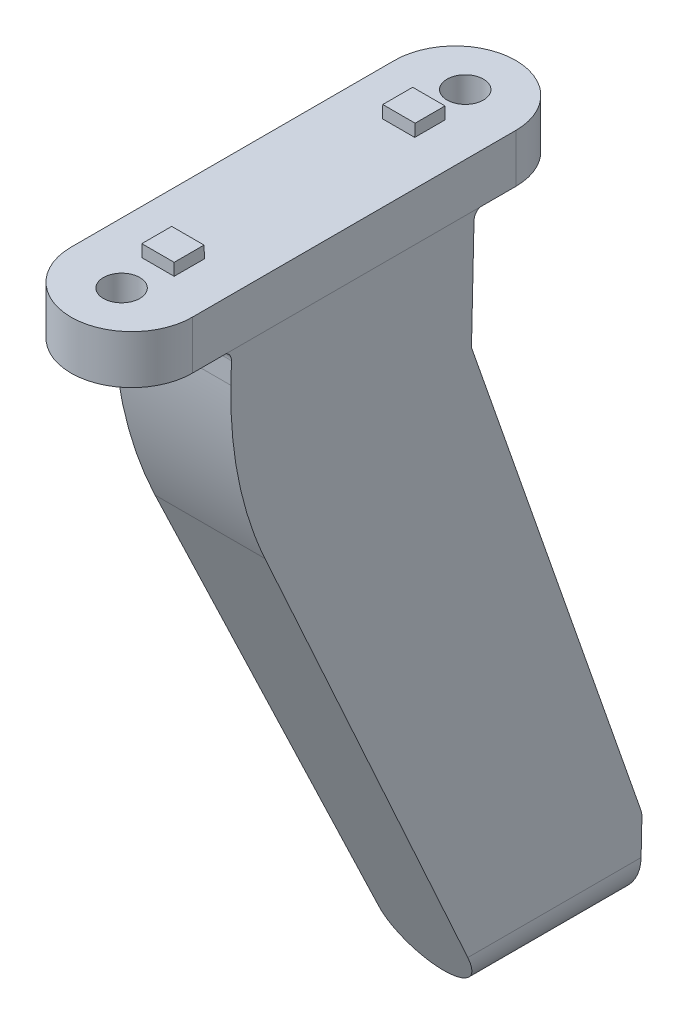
ISO-10303-21;
HEADER;
FILE_DESCRIPTION(('STEP AP214'),'2;1');
FILE_NAME('part.step','',(''),(''),'','','');
FILE_SCHEMA(('AUTOMOTIVE_DESIGN { 1 0 10303 214 1 1 1 1 }'));
ENDSEC;
DATA;
#1=APPLICATION_CONTEXT('core data for automotive mechanical design processes');
#2=APPLICATION_PROTOCOL_DEFINITION('international standard','automotive_design',2000,#1);
#3=PRODUCT_CONTEXT('',#1,'mechanical');
#4=PRODUCT('Part','Part','',(#3));
#5=PRODUCT_RELATED_PRODUCT_CATEGORY('part','',(#4));
#6=PRODUCT_DEFINITION_FORMATION('','',#4);
#7=PRODUCT_DEFINITION_CONTEXT('part definition',#1,'design');
#8=PRODUCT_DEFINITION('design','',#6,#7);
#9=PRODUCT_DEFINITION_SHAPE('','',#8);
#10=(LENGTH_UNIT() NAMED_UNIT(*) SI_UNIT(.MILLI.,.METRE.));
#11=(NAMED_UNIT(*) PLANE_ANGLE_UNIT() SI_UNIT($,.RADIAN.));
#12=(NAMED_UNIT(*) SI_UNIT($,.STERADIAN.) SOLID_ANGLE_UNIT());
#13=UNCERTAINTY_MEASURE_WITH_UNIT(LENGTH_MEASURE(1.E-05),#10,'distance_accuracy_value','');
#14=(GEOMETRIC_REPRESENTATION_CONTEXT(3) GLOBAL_UNCERTAINTY_ASSIGNED_CONTEXT((#13)) GLOBAL_UNIT_ASSIGNED_CONTEXT((#10,
#11,#12)) REPRESENTATION_CONTEXT('',''));
#15=CARTESIAN_POINT('',(0.,0.,0.));
#16=DIRECTION('',(0.,0.,1.));
#17=DIRECTION('',(1.,0.,0.));
#18=AXIS2_PLACEMENT_3D('',#15,#16,#17);
#19=CARTESIAN_POINT('',(0.,-9.7,0.));
#20=DIRECTION('',(0.,-1.,0.));
#21=DIRECTION('',(0.,0.,-1.));
#22=AXIS2_PLACEMENT_3D('',#19,#20,#21);
#23=CONICAL_SURFACE('',#22,6.825,0.790803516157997);
#24=CARTESIAN_POINT('',(0.,-7.4,0.));
#25=DIRECTION('',(0.,-1.,0.));
#26=DIRECTION('',(0.,0.,-1.));
#27=AXIS2_PLACEMENT_3D('',#24,#25,#26);
#28=CIRCLE('',#27,4.5);
#29=CARTESIAN_POINT('',(0.,-7.4,-4.5));
#30=VERTEX_POINT('',#29);
#31=EDGE_CURVE('E11',#30,#30,#28,.T.);
#32=ORIENTED_EDGE('',*,*,#31,.F.);
#33=EDGE_LOOP('',(#32));
#34=FACE_BOUND('',#33,.T.);
#35=CARTESIAN_POINT('',(0.,-12.,0.));
#36=DIRECTION('',(0.,1.,0.));
#37=DIRECTION('',(1.,0.,0.));
#38=AXIS2_PLACEMENT_3D('',#35,#36,#37);
#39=CIRCLE('',#38,9.15);
#40=CARTESIAN_POINT('',(9.15,-12.,0.));
#41=VERTEX_POINT('',#40);
#42=EDGE_CURVE('E292',#41,#41,#39,.T.);
#43=ORIENTED_EDGE('',*,*,#42,.F.);
#44=EDGE_LOOP('',(#43));
#45=FACE_BOUND('',#44,.T.);
#46=ADVANCED_FACE('F35',(#34,#45),#23,.F.);
#47=CARTESIAN_POINT('',(0.,-3.7,0.));
#48=DIRECTION('',(0.,1.,0.));
#49=DIRECTION('',(1.,0.,0.));
#50=AXIS2_PLACEMENT_3D('',#47,#48,#49);
#51=CYLINDRICAL_SURFACE('',#50,4.5);
#52=CARTESIAN_POINT('',(0.,0.,0.));
#53=DIRECTION('',(0.,-1.,0.));
#54=DIRECTION('',(0.,0.,-1.));
#55=AXIS2_PLACEMENT_3D('',#52,#53,#54);
#56=CIRCLE('',#55,4.5);
#57=CARTESIAN_POINT('',(0.,0.,-4.5));
#58=VERTEX_POINT('',#57);
#59=EDGE_CURVE('E200',#58,#58,#56,.T.);
#60=ORIENTED_EDGE('',*,*,#59,.F.);
#61=EDGE_LOOP('',(#60));
#62=FACE_BOUND('',#61,.T.);
#63=ORIENTED_EDGE('',*,*,#31,.T.);
#64=EDGE_LOOP('',(#63));
#65=FACE_BOUND('',#64,.T.);
#66=ADVANCED_FACE('F461',(#62,#65),#51,.F.);
#67=CARTESIAN_POINT('',(0.,-9.7,85.));
#68=DIRECTION('',(0.,-1.,0.));
#69=DIRECTION('',(0.,0.,-1.));
#70=AXIS2_PLACEMENT_3D('',#67,#68,#69);
#71=CONICAL_SURFACE('',#70,6.825,0.790803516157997);
#72=CARTESIAN_POINT('',(0.,-7.4,85.));
#73=DIRECTION('',(0.,-1.,0.));
#74=DIRECTION('',(0.,0.,-1.));
#75=AXIS2_PLACEMENT_3D('',#72,#73,#74);
#76=CIRCLE('',#75,4.5);
#77=CARTESIAN_POINT('',(0.,-7.4,80.5));
#78=VERTEX_POINT('',#77);
#79=EDGE_CURVE('E44',#78,#78,#76,.T.);
#80=ORIENTED_EDGE('',*,*,#79,.F.);
#81=EDGE_LOOP('',(#80));
#82=FACE_BOUND('',#81,.T.);
#83=CARTESIAN_POINT('',(0.,-12.,85.));
#84=DIRECTION('',(0.,1.,0.));
#85=DIRECTION('',(1.,0.,0.));
#86=AXIS2_PLACEMENT_3D('',#83,#84,#85);
#87=CIRCLE('',#86,9.15);
#88=CARTESIAN_POINT('',(9.15,-12.,85.));
#89=VERTEX_POINT('',#88);
#90=EDGE_CURVE('E233',#89,#89,#87,.T.);
#91=ORIENTED_EDGE('',*,*,#90,.F.);
#92=EDGE_LOOP('',(#91));
#93=FACE_BOUND('',#92,.T.);
#94=ADVANCED_FACE('F467',(#82,#93),#71,.F.);
#95=CARTESIAN_POINT('',(0.,-3.7,85.));
#96=DIRECTION('',(0.,1.,0.));
#97=DIRECTION('',(1.,0.,0.));
#98=AXIS2_PLACEMENT_3D('',#95,#96,#97);
#99=CYLINDRICAL_SURFACE('',#98,4.5);
#100=CARTESIAN_POINT('',(0.,0.,85.));
#101=DIRECTION('',(0.,-1.,0.));
#102=DIRECTION('',(0.,0.,-1.));
#103=AXIS2_PLACEMENT_3D('',#100,#101,#102);
#104=CIRCLE('',#103,4.5);
#105=CARTESIAN_POINT('',(0.,0.,80.5));
#106=VERTEX_POINT('',#105);
#107=EDGE_CURVE('E306',#106,#106,#104,.T.);
#108=ORIENTED_EDGE('',*,*,#107,.F.);
#109=EDGE_LOOP('',(#108));
#110=FACE_BOUND('',#109,.T.);
#111=ORIENTED_EDGE('',*,*,#79,.T.);
#112=EDGE_LOOP('',(#111));
#113=FACE_BOUND('',#112,.T.);
#114=ADVANCED_FACE('F478',(#110,#113),#99,.F.);
#115=CARTESIAN_POINT('',(0.,-175.,-17.5));
#116=DIRECTION('',(0.,0.,1.));
#117=DIRECTION('',(1.,0.,0.));
#118=AXIS2_PLACEMENT_3D('',#115,#116,#117);
#119=CYLINDRICAL_SURFACE('',#118,4.188);
#120=CARTESIAN_POINT('',(0.,-175.,-2.5));
#121=DIRECTION('',(0.,0.,-1.));
#122=DIRECTION('',(0.,-1.,0.));
#123=AXIS2_PLACEMENT_3D('',#120,#121,#122);
#124=CIRCLE('',#123,4.188);
#125=CARTESIAN_POINT('',(0.,-179.188,-2.5));
#126=VERTEX_POINT('',#125);
#127=EDGE_CURVE('E303',#126,#126,#124,.T.);
#128=ORIENTED_EDGE('',*,*,#127,.F.);
#129=EDGE_LOOP('',(#128));
#130=FACE_BOUND('',#129,.T.);
#131=CARTESIAN_POINT('',(0.,-175.,-32.50000001));
#132=DIRECTION('',(0.,0.,1.));
#133=DIRECTION('',(1.,0.,0.));
#134=AXIS2_PLACEMENT_3D('',#131,#132,#133);
#135=CIRCLE('',#134,4.188);
#136=CARTESIAN_POINT('',(4.188,-175.,-32.50000001));
#137=VERTEX_POINT('',#136);
#138=EDGE_CURVE('E222',#137,#137,#135,.T.);
#139=ORIENTED_EDGE('',*,*,#138,.F.);
#140=EDGE_LOOP('',(#139));
#141=FACE_BOUND('',#140,.T.);
#142=ADVANCED_FACE('F480',(#130,#141),#119,.F.);
#143=CARTESIAN_POINT('',(0.,-175.,-1.29102853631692));
#144=DIRECTION('',(0.,0.,-1.));
#145=DIRECTION('',(0.,-1.,0.));
#146=AXIS2_PLACEMENT_3D('',#143,#144,#145);
#147=CONICAL_SURFACE('',#146,2.094,1.0471975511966);
#148=CARTESIAN_POINT('',(0.,-175.,-0.0820570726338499));
#149=VERTEX_POINT('',#148);
#150=VERTEX_LOOP('',#149);
#151=FACE_BOUND('',#150,.T.);
#152=ORIENTED_EDGE('',*,*,#127,.T.);
#153=EDGE_LOOP('',(#152));
#154=FACE_BOUND('',#153,.T.);
#155=ADVANCED_FACE('F474',(#151,#154),#147,.F.);
#156=CARTESIAN_POINT('',(-4.00000000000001,1.34844881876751,72.0477554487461));
#157=DIRECTION('',(-1.,0.,0.));
#158=DIRECTION('',(0.,0.,1.));
#159=AXIS2_PLACEMENT_3D('',#156,#157,#158);
#160=PLANE('',#159);
#161=DIRECTION('',(0.,0.,-1.));
#162=VECTOR('',#161,1.);
#163=CARTESIAN_POINT('',(-4.00000000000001,0.,76.));
#164=LINE('',#163,#162);
#165=CARTESIAN_POINT('',(-4.00000000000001,0.,76.));
#166=VERTEX_POINT('',#165);
#167=CARTESIAN_POINT('',(-4.00000000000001,0.,68.5000020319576));
#168=VERTEX_POINT('',#167);
#169=EDGE_CURVE('E56',#166,#168,#164,.T.);
#170=ORIENTED_EDGE('',*,*,#169,.F.);
#171=DIRECTION('',(0.,-1.,0.));
#172=VECTOR('',#171,1.);
#173=CARTESIAN_POINT('',(-4.00000000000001,3.,76.));
#174=LINE('',#173,#172);
#175=CARTESIAN_POINT('',(-4.00000000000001,3.,76.));
#176=VERTEX_POINT('',#175);
#177=EDGE_CURVE('E317',#176,#166,#174,.T.);
#178=ORIENTED_EDGE('',*,*,#177,.F.);
#179=DIRECTION('',(0.,0.,1.));
#180=VECTOR('',#179,1.);
#181=CARTESIAN_POINT('',(-4.00000000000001,3.,68.60476434));
#182=LINE('',#181,#180);
#183=CARTESIAN_POINT('',(-4.00000000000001,3.,68.60476434));
#184=VERTEX_POINT('',#183);
#185=EDGE_CURVE('E321',#184,#176,#182,.T.);
#186=ORIENTED_EDGE('',*,*,#185,.F.);
#187=DIRECTION('',(0.,0.999390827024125,0.0348994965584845));
#188=VECTOR('',#187,1.);
#189=CARTESIAN_POINT('',(-4.00000000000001,0.,68.5000020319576));
#190=LINE('',#189,#188);
#191=EDGE_CURVE('E312',#168,#184,#190,.T.);
#192=ORIENTED_EDGE('',*,*,#191,.F.);
#193=EDGE_LOOP('',(#170,#178,#186,#192));
#194=FACE_BOUND('',#193,.T.);
#195=ADVANCED_FACE('F625',(#194),#160,.T.);
#196=CARTESIAN_POINT('',(3.99999999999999,-0.9651005,68.46629998));
#197=DIRECTION('',(0.,0.0348994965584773,-0.999390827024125));
#198=DIRECTION('',(0.,0.999390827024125,0.0348994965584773));
#199=AXIS2_PLACEMENT_3D('',#196,#197,#198);
#200=PLANE('',#199);
#201=DIRECTION('',(1.,0.,0.));
#202=VECTOR('',#201,1.);
#203=CARTESIAN_POINT('',(-4.00000000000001,0.,68.5000020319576));
#204=LINE('',#203,#202);
#205=CARTESIAN_POINT('',(3.99999999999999,0.,68.5000020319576));
#206=VERTEX_POINT('',#205);
#207=EDGE_CURVE('E316',#168,#206,#204,.T.);
#208=ORIENTED_EDGE('',*,*,#207,.F.);
#209=ORIENTED_EDGE('',*,*,#191,.T.);
#210=DIRECTION('',(-1.,0.,0.));
#211=VECTOR('',#210,1.);
#212=CARTESIAN_POINT('',(3.99999999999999,3.,68.60476434));
#213=LINE('',#212,#211);
#214=CARTESIAN_POINT('',(3.99999999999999,3.,68.60476434));
#215=VERTEX_POINT('',#214);
#216=EDGE_CURVE('E319',#215,#184,#213,.T.);
#217=ORIENTED_EDGE('',*,*,#216,.F.);
#218=DIRECTION('',(0.,0.999390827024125,0.0348994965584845));
#219=VECTOR('',#218,1.);
#220=CARTESIAN_POINT('',(3.99999999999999,0.,68.5000020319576));
#221=LINE('',#220,#219);
#222=EDGE_CURVE('E330',#206,#215,#221,.T.);
#223=ORIENTED_EDGE('',*,*,#222,.F.);
#224=EDGE_LOOP('',(#208,#209,#217,#223));
#225=FACE_BOUND('',#224,.T.);
#226=ADVANCED_FACE('F632',(#225),#200,.T.);
#227=CARTESIAN_POINT('',(3.99999999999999,3.,68.60476434));
#228=DIRECTION('',(0.,1.,0.));
#229=DIRECTION('',(0.,0.,1.));
#230=AXIS2_PLACEMENT_3D('',#227,#228,#229);
#231=PLANE('',#230);
#232=ORIENTED_EDGE('',*,*,#185,.T.);
#233=DIRECTION('',(-1.,0.,0.));
#234=VECTOR('',#233,1.);
#235=CARTESIAN_POINT('',(3.99999999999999,3.,76.));
#236=LINE('',#235,#234);
#237=CARTESIAN_POINT('',(3.99999999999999,3.,76.));
#238=VERTEX_POINT('',#237);
#239=EDGE_CURVE('E320',#238,#176,#236,.T.);
#240=ORIENTED_EDGE('',*,*,#239,.F.);
#241=DIRECTION('',(0.,0.,1.));
#242=VECTOR('',#241,1.);
#243=CARTESIAN_POINT('',(3.99999999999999,3.,68.60476434));
#244=LINE('',#243,#242);
#245=EDGE_CURVE('E332',#215,#238,#244,.T.);
#246=ORIENTED_EDGE('',*,*,#245,.F.);
#247=ORIENTED_EDGE('',*,*,#216,.T.);
#248=EDGE_LOOP('',(#232,#240,#246,#247));
#249=FACE_BOUND('',#248,.T.);
#250=ADVANCED_FACE('F640',(#249),#231,.T.);
#251=CARTESIAN_POINT('',(3.99999999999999,3.,76.));
#252=DIRECTION('',(0.,0.,1.));
#253=DIRECTION('',(1.,0.,0.));
#254=AXIS2_PLACEMENT_3D('',#251,#252,#253);
#255=PLANE('',#254);
#256=ORIENTED_EDGE('',*,*,#177,.T.);
#257=DIRECTION('',(-1.,0.,0.));
#258=VECTOR('',#257,1.);
#259=CARTESIAN_POINT('',(3.99999999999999,0.,76.));
#260=LINE('',#259,#258);
#261=CARTESIAN_POINT('',(3.99999999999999,0.,76.));
#262=VERTEX_POINT('',#261);
#263=EDGE_CURVE('E300',#262,#166,#260,.T.);
#264=ORIENTED_EDGE('',*,*,#263,.F.);
#265=DIRECTION('',(0.,-1.,0.));
#266=VECTOR('',#265,1.);
#267=CARTESIAN_POINT('',(3.99999999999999,3.,76.));
#268=LINE('',#267,#266);
#269=EDGE_CURVE('E336',#238,#262,#268,.T.);
#270=ORIENTED_EDGE('',*,*,#269,.F.);
#271=ORIENTED_EDGE('',*,*,#239,.T.);
#272=EDGE_LOOP('',(#256,#264,#270,#271));
#273=FACE_BOUND('',#272,.T.);
#274=ADVANCED_FACE('F649',(#273),#255,.T.);
#275=CARTESIAN_POINT('',(3.99999999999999,1.34844881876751,72.0477554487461));
#276=DIRECTION('',(-1.,0.,0.));
#277=DIRECTION('',(0.,0.,1.));
#278=AXIS2_PLACEMENT_3D('',#275,#276,#277);
#279=PLANE('',#278);
#280=DIRECTION('',(0.,0.,1.));
#281=VECTOR('',#280,1.);
#282=CARTESIAN_POINT('',(3.99999999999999,0.,68.5000020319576));
#283=LINE('',#282,#281);
#284=EDGE_CURVE('E327',#206,#262,#283,.T.);
#285=ORIENTED_EDGE('',*,*,#284,.F.);
#286=ORIENTED_EDGE('',*,*,#222,.T.);
#287=ORIENTED_EDGE('',*,*,#245,.T.);
#288=ORIENTED_EDGE('',*,*,#269,.T.);
#289=EDGE_LOOP('',(#285,#286,#287,#288));
#290=FACE_BOUND('',#289,.T.);
#291=ADVANCED_FACE('F658',(#290),#279,.F.);
#292=CARTESIAN_POINT('',(4.,1.34844881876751,12.9522445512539));
#293=DIRECTION('',(1.,0.,0.));
#294=DIRECTION('',(0.,0.,-1.));
#295=AXIS2_PLACEMENT_3D('',#292,#293,#294);
#296=PLANE('',#295);
#297=DIRECTION('',(0.,0.,1.));
#298=VECTOR('',#297,1.);
#299=CARTESIAN_POINT('',(4.,0.,9.));
#300=LINE('',#299,#298);
#301=CARTESIAN_POINT('',(4.,0.,9.));
#302=VERTEX_POINT('',#301);
#303=CARTESIAN_POINT('',(4.,0.,16.4999979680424));
#304=VERTEX_POINT('',#303);
#305=EDGE_CURVE('E345',#302,#304,#300,.T.);
#306=ORIENTED_EDGE('',*,*,#305,.F.);
#307=DIRECTION('',(0.,-1.,0.));
#308=VECTOR('',#307,1.);
#309=CARTESIAN_POINT('',(4.,3.,9.));
#310=LINE('',#309,#308);
#311=CARTESIAN_POINT('',(4.,3.,9.));
#312=VERTEX_POINT('',#311);
#313=EDGE_CURVE('E348',#312,#302,#310,.T.);
#314=ORIENTED_EDGE('',*,*,#313,.F.);
#315=DIRECTION('',(0.,0.,-1.));
#316=VECTOR('',#315,1.);
#317=CARTESIAN_POINT('',(4.,3.,16.39523566));
#318=LINE('',#317,#316);
#319=CARTESIAN_POINT('',(4.,3.,16.39523566));
#320=VERTEX_POINT('',#319);
#321=EDGE_CURVE('E353',#320,#312,#318,.T.);
#322=ORIENTED_EDGE('',*,*,#321,.F.);
#323=DIRECTION('',(0.,0.999390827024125,-0.0348994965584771));
#324=VECTOR('',#323,1.);
#325=CARTESIAN_POINT('',(4.,0.,16.4999979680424));
#326=LINE('',#325,#324);
#327=EDGE_CURVE('E341',#304,#320,#326,.T.);
#328=ORIENTED_EDGE('',*,*,#327,.F.);
#329=EDGE_LOOP('',(#306,#314,#322,#328));
#330=FACE_BOUND('',#329,.T.);
#331=ADVANCED_FACE('F667',(#330),#296,.T.);
#332=CARTESIAN_POINT('',(-4.,-0.9651005,16.53370002));
#333=DIRECTION('',(0.,0.0348994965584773,0.999390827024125));
#334=DIRECTION('',(0.,-0.999390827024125,0.0348994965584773));
#335=AXIS2_PLACEMENT_3D('',#332,#333,#334);
#336=PLANE('',#335);
#337=DIRECTION('',(-1.,0.,0.));
#338=VECTOR('',#337,1.);
#339=CARTESIAN_POINT('',(4.,0.,16.4999979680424));
#340=LINE('',#339,#338);
#341=CARTESIAN_POINT('',(-4.,0.,16.4999979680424));
#342=VERTEX_POINT('',#341);
#343=EDGE_CURVE('E347',#304,#342,#340,.T.);
#344=ORIENTED_EDGE('',*,*,#343,.F.);
#345=ORIENTED_EDGE('',*,*,#327,.T.);
#346=DIRECTION('',(1.,0.,0.));
#347=VECTOR('',#346,1.);
#348=CARTESIAN_POINT('',(-4.,3.,16.39523566));
#349=LINE('',#348,#347);
#350=CARTESIAN_POINT('',(-4.,3.,16.39523566));
#351=VERTEX_POINT('',#350);
#352=EDGE_CURVE('E351',#351,#320,#349,.T.);
#353=ORIENTED_EDGE('',*,*,#352,.F.);
#354=DIRECTION('',(0.,0.999390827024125,-0.0348994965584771));
#355=VECTOR('',#354,1.);
#356=CARTESIAN_POINT('',(-4.,0.,16.4999979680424));
#357=LINE('',#356,#355);
#358=EDGE_CURVE('E361',#342,#351,#357,.T.);
#359=ORIENTED_EDGE('',*,*,#358,.F.);
#360=EDGE_LOOP('',(#344,#345,#353,#359));
#361=FACE_BOUND('',#360,.T.);
#362=ADVANCED_FACE('F676',(#361),#336,.T.);
#363=CARTESIAN_POINT('',(-4.,3.,16.39523566));
#364=DIRECTION('',(0.,1.,0.));
#365=DIRECTION('',(0.,0.,1.));
#366=AXIS2_PLACEMENT_3D('',#363,#364,#365);
#367=PLANE('',#366);
#368=ORIENTED_EDGE('',*,*,#321,.T.);
#369=DIRECTION('',(1.,0.,0.));
#370=VECTOR('',#369,1.);
#371=CARTESIAN_POINT('',(-4.,3.,9.));
#372=LINE('',#371,#370);
#373=CARTESIAN_POINT('',(-4.,3.,9.));
#374=VERTEX_POINT('',#373);
#375=EDGE_CURVE('E352',#374,#312,#372,.T.);
#376=ORIENTED_EDGE('',*,*,#375,.F.);
#377=DIRECTION('',(0.,0.,-1.));
#378=VECTOR('',#377,1.);
#379=CARTESIAN_POINT('',(-4.,3.,16.39523566));
#380=LINE('',#379,#378);
#381=EDGE_CURVE('E363',#351,#374,#380,.T.);
#382=ORIENTED_EDGE('',*,*,#381,.F.);
#383=ORIENTED_EDGE('',*,*,#352,.T.);
#384=EDGE_LOOP('',(#368,#376,#382,#383));
#385=FACE_BOUND('',#384,.T.);
#386=ADVANCED_FACE('F685',(#385),#367,.T.);
#387=CARTESIAN_POINT('',(-4.,3.,9.));
#388=DIRECTION('',(0.,0.,-1.));
#389=DIRECTION('',(-1.,0.,0.));
#390=AXIS2_PLACEMENT_3D('',#387,#388,#389);
#391=PLANE('',#390);
#392=ORIENTED_EDGE('',*,*,#313,.T.);
#393=DIRECTION('',(1.,0.,0.));
#394=VECTOR('',#393,1.);
#395=CARTESIAN_POINT('',(-4.,0.,9.));
#396=LINE('',#395,#394);
#397=CARTESIAN_POINT('',(-4.,0.,9.));
#398=VERTEX_POINT('',#397);
#399=EDGE_CURVE('E344',#398,#302,#396,.T.);
#400=ORIENTED_EDGE('',*,*,#399,.F.);
#401=DIRECTION('',(0.,-1.,0.));
#402=VECTOR('',#401,1.);
#403=CARTESIAN_POINT('',(-4.,3.,9.));
#404=LINE('',#403,#402);
#405=EDGE_CURVE('E367',#374,#398,#404,.T.);
#406=ORIENTED_EDGE('',*,*,#405,.F.);
#407=ORIENTED_EDGE('',*,*,#375,.T.);
#408=EDGE_LOOP('',(#392,#400,#406,#407));
#409=FACE_BOUND('',#408,.T.);
#410=ADVANCED_FACE('F694',(#409),#391,.T.);
#411=CARTESIAN_POINT('',(-4.,1.34844881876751,12.9522445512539));
#412=DIRECTION('',(1.,0.,0.));
#413=DIRECTION('',(0.,0.,-1.));
#414=AXIS2_PLACEMENT_3D('',#411,#412,#413);
#415=PLANE('',#414);
#416=DIRECTION('',(0.,0.,-1.));
#417=VECTOR('',#416,1.);
#418=CARTESIAN_POINT('',(-4.,0.,16.4999979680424));
#419=LINE('',#418,#417);
#420=EDGE_CURVE('E309',#342,#398,#419,.T.);
#421=ORIENTED_EDGE('',*,*,#420,.F.);
#422=ORIENTED_EDGE('',*,*,#358,.T.);
#423=ORIENTED_EDGE('',*,*,#381,.T.);
#424=ORIENTED_EDGE('',*,*,#405,.T.);
#425=EDGE_LOOP('',(#421,#422,#423,#424));
#426=FACE_BOUND('',#425,.T.);
#427=ADVANCED_FACE('F486',(#426),#415,.F.);
#428=CARTESIAN_POINT('',(5.00001284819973E-09,-174.999999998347,97.5));
#429=DIRECTION('',(0.,0.,1.));
#430=DIRECTION('',(1.,0.,0.));
#431=AXIS2_PLACEMENT_3D('',#428,#429,#430);
#432=CYLINDRICAL_SURFACE('',#431,11.0000000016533);
#433=CARTESIAN_POINT('',(5.00001284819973E-09,-174.999999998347,10.4810814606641));
#434=DIRECTION('',(0.,0.422618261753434,-0.906307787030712));
#435=DIRECTION('',(0.,-0.906307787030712,-0.422618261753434));
#436=AXIS2_PLACEMENT_3D('',#433,#434,#435);
#437=ELLIPSE('',#436,12.1371571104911,11.0000000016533);
#438=CARTESIAN_POINT('',(10.99713178,-175.25118272,10.3639530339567));
#439=VERTEX_POINT('',#438);
#440=CARTESIAN_POINT('',(-10.99713177,-175.25118272,10.3639530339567));
#441=VERTEX_POINT('',#440);
#442=EDGE_CURVE('E372',#439,#441,#437,.T.);
#443=ORIENTED_EDGE('',*,*,#442,.T.);
#444=DIRECTION('',(0.,0.,-1.));
#445=VECTOR('',#444,1.);
#446=CARTESIAN_POINT('',(-10.99713177,-175.25118272,10.3639530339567));
#447=LINE('',#446,#445);
#448=CARTESIAN_POINT('',(-10.99713177,-175.25118272,-32.5000000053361));
#449=VERTEX_POINT('',#448);
#450=EDGE_CURVE('E377',#441,#449,#447,.T.);
#451=ORIENTED_EDGE('',*,*,#450,.T.);
#452=CARTESIAN_POINT('',(5.00001284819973E-09,-174.999999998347,-32.50000001));
#453=DIRECTION('',(0.,0.,1.));
#454=DIRECTION('',(1.,0.,0.));
#455=AXIS2_PLACEMENT_3D('',#452,#453,#454);
#456=CIRCLE('',#455,11.0000000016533);
#457=CARTESIAN_POINT('',(10.99713178,-175.25118272,-32.5000000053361));
#458=VERTEX_POINT('',#457);
#459=EDGE_CURVE('E380',#449,#458,#456,.T.);
#460=ORIENTED_EDGE('',*,*,#459,.T.);
#461=DIRECTION('',(0.,0.,-1.));
#462=VECTOR('',#461,1.);
#463=CARTESIAN_POINT('',(10.99713178,-175.25118272,10.3639530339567));
#464=LINE('',#463,#462);
#465=EDGE_CURVE('E383',#439,#458,#464,.T.);
#466=ORIENTED_EDGE('',*,*,#465,.F.);
#467=EDGE_LOOP('',(#443,#451,#460,#466));
#468=FACE_BOUND('',#467,.T.);
#469=ADVANCED_FACE('F443',(#468),#432,.T.);
#470=CARTESIAN_POINT('',(-14.725911,-12.,97.5));
#471=DIRECTION('',(-0.999739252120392,-0.0228347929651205,0.));
#472=DIRECTION('',(0.0228347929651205,-0.999739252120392,0.));
#473=AXIS2_PLACEMENT_3D('',#470,#471,#472);
#474=PLANE('',#473);
#475=CARTESIAN_POINT('',(-14.6688091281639,-14.5000000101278,75.0000000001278));
#476=DIRECTION('',(0.999739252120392,0.0228347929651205,0.));
#477=DIRECTION('',(-0.0228347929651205,0.999739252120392,4.05007713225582E-09));
#478=AXIS2_PLACEMENT_3D('',#475,#476,#477);
#479=ELLIPSE('',#478,2.50065204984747,2.50000001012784);
#480=CARTESIAN_POINT('',(-14.6688091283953,-14.5,72.4999999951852));
#481=VERTEX_POINT('',#480);
#482=CARTESIAN_POINT('',(-14.725911,-12.,75.0000000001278));
#483=VERTEX_POINT('',#482);
#484=EDGE_CURVE('E268',#481,#483,#479,.T.);
#485=ORIENTED_EDGE('',*,*,#484,.T.);
#486=DIRECTION('',(0.,0.,-1.));
#487=VECTOR('',#486,1.);
#488=CARTESIAN_POINT('',(-14.725911,-12.,75.0000000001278));
#489=LINE('',#488,#487);
#490=CARTESIAN_POINT('',(-14.725911,-12.,9.99999998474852));
#491=VERTEX_POINT('',#490);
#492=EDGE_CURVE('E388',#483,#491,#489,.T.);
#493=ORIENTED_EDGE('',*,*,#492,.T.);
#494=CARTESIAN_POINT('',(-14.6688091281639,-14.5000000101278,9.99999997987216));
#495=DIRECTION('',(0.999739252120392,0.0228347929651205,0.));
#496=DIRECTION('',(-0.0228347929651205,0.999739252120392,4.05007464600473E-09));
#497=AXIS2_PLACEMENT_3D('',#494,#495,#496);
#498=ELLIPSE('',#497,2.50065204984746,2.50000001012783);
#499=CARTESIAN_POINT('',(-14.6688091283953,-14.5,12.49999999));
#500=VERTEX_POINT('',#499);
#501=EDGE_CURVE('E391',#491,#500,#498,.T.);
#502=ORIENTED_EDGE('',*,*,#501,.T.);
#503=DIRECTION('',(0.0228347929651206,-0.999739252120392,0.));
#504=VECTOR('',#503,1.);
#505=CARTESIAN_POINT('',(-14.6688091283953,-14.5,12.49999999));
#506=LINE('',#505,#504);
#507=CARTESIAN_POINT('',(-14.0406885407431,-42.,12.49999999));
#508=VERTEX_POINT('',#507);
#509=EDGE_CURVE('E394',#500,#508,#506,.T.);
#510=ORIENTED_EDGE('',*,*,#509,.T.);
#511=DIRECTION('',(0.0214583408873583,-0.939476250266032,-0.341941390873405));
#512=VECTOR('',#511,1.);
#513=CARTESIAN_POINT('',(-14.0406885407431,-42.,12.49999999));
#514=LINE('',#513,#512);
#515=CARTESIAN_POINT('',(-11.235661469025,-164.80801806,-32.19846311));
#516=VERTEX_POINT('',#515);
#517=EDGE_CURVE('E397',#508,#516,#514,.T.);
#518=ORIENTED_EDGE('',*,*,#517,.T.);
#519=CARTESIAN_POINT('',(-11.1966014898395,-166.518118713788,-27.5000004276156));
#520=DIRECTION('',(-0.999739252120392,-0.0228347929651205,0.));
#521=DIRECTION('',(-0.0228347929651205,0.999739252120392,-1.32390013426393E-08));
#522=AXIS2_PLACEMENT_3D('',#519,#520,#521);
#523=ELLIPSE('',#522,5.00130366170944,4.99999958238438);
#524=CARTESIAN_POINT('',(-11.1966014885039,-166.518118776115,-32.5000000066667));
#525=VERTEX_POINT('',#524);
#526=EDGE_CURVE('E400',#516,#525,#523,.T.);
#527=ORIENTED_EDGE('',*,*,#526,.T.);
#528=DIRECTION('',(0.022834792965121,-0.999739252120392,0.));
#529=VECTOR('',#528,1.);
#530=CARTESIAN_POINT('',(-11.1966014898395,-166.518118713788,-32.5));
#531=LINE('',#530,#529);
#532=EDGE_CURVE('E403',#525,#449,#531,.T.);
#533=ORIENTED_EDGE('',*,*,#532,.T.);
#534=ORIENTED_EDGE('',*,*,#450,.F.);
#535=DIRECTION('',(-0.0206963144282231,0.90611366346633,0.422527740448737));
#536=VECTOR('',#535,1.);
#537=CARTESIAN_POINT('',(-10.99713177,-175.25118272,10.3639530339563));
#538=LINE('',#537,#536);
#539=CARTESIAN_POINT('',(-13.5817639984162,-62.0923599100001,63.1307787));
#540=VERTEX_POINT('',#539);
#541=EDGE_CURVE('E406',#441,#540,#538,.T.);
#542=ORIENTED_EDGE('',*,*,#541,.T.);
#543=CARTESIAN_POINT('',(-14.5470557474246,-19.8305337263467,-27.5000000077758));
#544=DIRECTION('',(-0.999739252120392,-0.0228347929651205,0.));
#545=DIRECTION('',(0.0228347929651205,-0.999739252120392,-1.36497726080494E-10));
#546=AXIS2_PLACEMENT_3D('',#543,#544,#545);
#547=ELLIPSE('',#546,100.026081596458,100.000000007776);
#548=CARTESIAN_POINT('',(-14.5470557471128,-19.83053374,72.5));
#549=VERTEX_POINT('',#548);
#550=EDGE_CURVE('E409',#540,#549,#547,.T.);
#551=ORIENTED_EDGE('',*,*,#550,.T.);
#552=DIRECTION('',(-0.022834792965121,0.999739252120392,0.));
#553=VECTOR('',#552,1.);
#554=CARTESIAN_POINT('',(-14.5470557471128,-19.83053374,72.5));
#555=LINE('',#554,#553);
#556=EDGE_CURVE('E272',#549,#481,#555,.T.);
#557=ORIENTED_EDGE('',*,*,#556,.T.);
#558=EDGE_LOOP('',(#485,#493,#502,#510,#518,#527,#533,#534,#542,#551,#557));
#559=FACE_BOUND('',#558,.T.);
#560=ADVANCED_FACE('F433',(#559),#474,.T.);
#561=CARTESIAN_POINT('',(10.99713178,-175.25118272,97.5));
#562=DIRECTION('',(0.999739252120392,-0.0228347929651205,0.));
#563=DIRECTION('',(0.0228347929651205,0.999739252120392,0.));
#564=AXIS2_PLACEMENT_3D('',#561,#562,#563);
#565=PLANE('',#564);
#566=DIRECTION('',(-0.0206963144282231,-0.906113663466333,-0.422527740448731));
#567=VECTOR('',#566,1.);
#568=CARTESIAN_POINT('',(13.5817640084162,-62.0923599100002,63.1307787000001));
#569=LINE('',#568,#567);
#570=CARTESIAN_POINT('',(13.5817640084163,-62.0923599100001,63.1307787));
#571=VERTEX_POINT('',#570);
#572=EDGE_CURVE('E385',#571,#439,#569,.T.);
#573=ORIENTED_EDGE('',*,*,#572,.T.);
#574=ORIENTED_EDGE('',*,*,#465,.T.);
#575=DIRECTION('',(0.0228347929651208,0.999739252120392,0.));
#576=VECTOR('',#575,1.);
#577=CARTESIAN_POINT('',(10.99713178,-175.25118272,-32.5));
#578=LINE('',#577,#576);
#579=CARTESIAN_POINT('',(11.1966014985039,-166.518118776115,-32.5000000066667));
#580=VERTEX_POINT('',#579);
#581=EDGE_CURVE('E386',#458,#580,#578,.T.);
#582=ORIENTED_EDGE('',*,*,#581,.T.);
#583=CARTESIAN_POINT('',(11.1966014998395,-166.518118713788,-27.5000004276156));
#584=DIRECTION('',(0.999739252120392,-0.0228347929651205,0.));
#585=DIRECTION('',(0.0228347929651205,0.999739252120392,-1.32390013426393E-08));
#586=AXIS2_PLACEMENT_3D('',#583,#584,#585);
#587=ELLIPSE('',#586,5.00130366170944,4.99999958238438);
#588=CARTESIAN_POINT('',(11.235661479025,-164.80801806,-32.19846311));
#589=VERTEX_POINT('',#588);
#590=EDGE_CURVE('E415',#580,#589,#587,.T.);
#591=ORIENTED_EDGE('',*,*,#590,.T.);
#592=DIRECTION('',(0.0214583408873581,0.939476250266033,0.341941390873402));
#593=VECTOR('',#592,1.);
#594=CARTESIAN_POINT('',(11.235661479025,-164.80801806,-32.1984631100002));
#595=LINE('',#594,#593);
#596=CARTESIAN_POINT('',(14.0406885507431,-42.,12.49999999));
#597=VERTEX_POINT('',#596);
#598=EDGE_CURVE('E418',#589,#597,#595,.T.);
#599=ORIENTED_EDGE('',*,*,#598,.T.);
#600=DIRECTION('',(0.0228347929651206,0.999739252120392,0.));
#601=VECTOR('',#600,1.);
#602=CARTESIAN_POINT('',(14.0406885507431,-42.,12.49999999));
#603=LINE('',#602,#601);
#604=CARTESIAN_POINT('',(14.6688091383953,-14.5,12.49999999));
#605=VERTEX_POINT('',#604);
#606=EDGE_CURVE('E285',#597,#605,#603,.T.);
#607=ORIENTED_EDGE('',*,*,#606,.T.);
#608=CARTESIAN_POINT('',(14.668809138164,-14.5000000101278,9.99999997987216));
#609=DIRECTION('',(-0.999739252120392,0.0228347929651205,0.));
#610=DIRECTION('',(0.0228347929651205,0.999739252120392,4.05007464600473E-09));
#611=AXIS2_PLACEMENT_3D('',#608,#609,#610);
#612=ELLIPSE('',#611,2.50065204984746,2.50000001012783);
#613=CARTESIAN_POINT('',(14.72591101,-12.,9.99999998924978));
#614=VERTEX_POINT('',#613);
#615=EDGE_CURVE('E283',#605,#614,#612,.T.);
#616=ORIENTED_EDGE('',*,*,#615,.T.);
#617=DIRECTION('',(0.,0.,-1.));
#618=VECTOR('',#617,1.);
#619=CARTESIAN_POINT('',(14.72591101,-12.,75.0000000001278));
#620=LINE('',#619,#618);
#621=CARTESIAN_POINT('',(14.72591101,-12.,75.0000000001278));
#622=VERTEX_POINT('',#621);
#623=EDGE_CURVE('E232',#622,#614,#620,.T.);
#624=ORIENTED_EDGE('',*,*,#623,.F.);
#625=CARTESIAN_POINT('',(14.668809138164,-14.5000000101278,75.0000000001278));
#626=DIRECTION('',(-0.999739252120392,0.0228347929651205,0.));
#627=DIRECTION('',(0.0228347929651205,0.999739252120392,4.05007713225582E-09));
#628=AXIS2_PLACEMENT_3D('',#625,#626,#627);
#629=ELLIPSE('',#628,2.50065204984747,2.50000001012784);
#630=CARTESIAN_POINT('',(14.6688091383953,-14.5,72.4999999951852));
#631=VERTEX_POINT('',#630);
#632=EDGE_CURVE('E265',#622,#631,#629,.T.);
#633=ORIENTED_EDGE('',*,*,#632,.T.);
#634=DIRECTION('',(-0.022834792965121,-0.999739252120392,0.));
#635=VECTOR('',#634,1.);
#636=CARTESIAN_POINT('',(14.6688091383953,-14.5,72.5));
#637=LINE('',#636,#635);
#638=CARTESIAN_POINT('',(14.5470557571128,-19.83053374,72.5));
#639=VERTEX_POINT('',#638);
#640=EDGE_CURVE('E275',#631,#639,#637,.T.);
#641=ORIENTED_EDGE('',*,*,#640,.T.);
#642=CARTESIAN_POINT('',(14.5470557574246,-19.8305337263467,-27.5000000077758));
#643=DIRECTION('',(0.999739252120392,-0.0228347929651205,0.));
#644=DIRECTION('',(-0.0228347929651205,-0.999739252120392,-1.36497726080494E-10));
#645=AXIS2_PLACEMENT_3D('',#642,#643,#644);
#646=ELLIPSE('',#645,100.026081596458,100.000000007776);
#647=EDGE_CURVE('E278',#639,#571,#646,.T.);
#648=ORIENTED_EDGE('',*,*,#647,.T.);
#649=EDGE_LOOP('',(#573,#574,#582,#591,#599,#607,#616,#624,#633,#641,#648));
#650=FACE_BOUND('',#649,.T.);
#651=ADVANCED_FACE('F281',(#650),#565,.T.);
#652=CARTESIAN_POINT('',(-15.,-19.8305337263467,-27.5000000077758));
#653=DIRECTION('',(-1.,0.,0.));
#654=DIRECTION('',(0.,0.,1.));
#655=AXIS2_PLACEMENT_3D('',#652,#653,#654);
#656=CYLINDRICAL_SURFACE('',#655,100.000000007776);
#657=ORIENTED_EDGE('',*,*,#550,.F.);
#658=DIRECTION('',(1.,0.,0.));
#659=VECTOR('',#658,1.);
#660=CARTESIAN_POINT('',(-13.5817639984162,-62.0923599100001,63.1307787));
#661=LINE('',#660,#659);
#662=EDGE_CURVE('E290',#540,#571,#661,.T.);
#663=ORIENTED_EDGE('',*,*,#662,.T.);
#664=ORIENTED_EDGE('',*,*,#647,.F.);
#665=DIRECTION('',(1.,0.,0.));
#666=VECTOR('',#665,1.);
#667=CARTESIAN_POINT('',(-14.5470557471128,-19.83053374,72.5));
#668=LINE('',#667,#666);
#669=EDGE_CURVE('E257',#549,#639,#668,.T.);
#670=ORIENTED_EDGE('',*,*,#669,.F.);
#671=EDGE_LOOP('',(#657,#663,#664,#670));
#672=FACE_BOUND('',#671,.T.);
#673=ADVANCED_FACE('F437',(#672),#656,.T.);
#674=CARTESIAN_POINT('',(-15.,-186.,5.35169722));
#675=DIRECTION('',(0.,-0.422618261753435,0.906307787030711));
#676=DIRECTION('',(0.,-0.906307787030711,-0.422618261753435));
#677=AXIS2_PLACEMENT_3D('',#674,#675,#676);
#678=PLANE('',#677);
#679=ORIENTED_EDGE('',*,*,#541,.F.);
#680=ORIENTED_EDGE('',*,*,#442,.F.);
#681=ORIENTED_EDGE('',*,*,#572,.F.);
#682=ORIENTED_EDGE('',*,*,#662,.F.);
#683=EDGE_LOOP('',(#679,#680,#681,#682));
#684=FACE_BOUND('',#683,.T.);
#685=ADVANCED_FACE('F441',(#684),#678,.T.);
#686=CARTESIAN_POINT('',(0.,-12.,82.5));
#687=DIRECTION('',(0.,-1.,0.));
#688=DIRECTION('',(0.,0.,-1.));
#689=AXIS2_PLACEMENT_3D('',#686,#687,#688);
#690=CYLINDRICAL_SURFACE('',#689,15.);
#691=CARTESIAN_POINT('',(0.,0.,82.5));
#692=DIRECTION('',(0.,-1.,0.));
#693=DIRECTION('',(0.,0.,-1.));
#694=AXIS2_PLACEMENT_3D('',#691,#692,#693);
#695=CIRCLE('',#694,15.);
#696=CARTESIAN_POINT('',(15.,0.,82.5));
#697=VERTEX_POINT('',#696);
#698=CARTESIAN_POINT('',(-15.,0.,82.5));
#699=VERTEX_POINT('',#698);
#700=EDGE_CURVE('E251',#697,#699,#695,.T.);
#701=ORIENTED_EDGE('',*,*,#700,.T.);
#702=DIRECTION('',(0.,1.,0.));
#703=VECTOR('',#702,1.);
#704=CARTESIAN_POINT('',(-15.,-12.,82.5));
#705=LINE('',#704,#703);
#706=CARTESIAN_POINT('',(-15.,-12.,82.5));
#707=VERTEX_POINT('',#706);
#708=EDGE_CURVE('E204',#707,#699,#705,.T.);
#709=ORIENTED_EDGE('',*,*,#708,.F.);
#710=CARTESIAN_POINT('',(0.,-12.,82.5));
#711=DIRECTION('',(0.,1.,0.));
#712=DIRECTION('',(1.,0.,0.));
#713=AXIS2_PLACEMENT_3D('',#710,#711,#712);
#714=CIRCLE('',#713,15.);
#715=CARTESIAN_POINT('',(15.,-12.,82.5));
#716=VERTEX_POINT('',#715);
#717=EDGE_CURVE('E253',#707,#716,#714,.T.);
#718=ORIENTED_EDGE('',*,*,#717,.T.);
#719=DIRECTION('',(0.,1.,0.));
#720=VECTOR('',#719,1.);
#721=CARTESIAN_POINT('',(15.,-12.,82.5));
#722=LINE('',#721,#720);
#723=EDGE_CURVE('E256',#716,#697,#722,.T.);
#724=ORIENTED_EDGE('',*,*,#723,.T.);
#725=EDGE_LOOP('',(#701,#709,#718,#724));
#726=FACE_BOUND('',#725,.T.);
#727=ADVANCED_FACE('F489',(#726),#690,.T.);
#728=CARTESIAN_POINT('',(-15.,-19.83053374,72.5));
#729=DIRECTION('',(0.,0.,1.));
#730=DIRECTION('',(1.,0.,0.));
#731=AXIS2_PLACEMENT_3D('',#728,#729,#730);
#732=PLANE('',#731);
#733=ORIENTED_EDGE('',*,*,#556,.F.);
#734=ORIENTED_EDGE('',*,*,#669,.T.);
#735=ORIENTED_EDGE('',*,*,#640,.F.);
#736=DIRECTION('',(1.,0.,0.));
#737=VECTOR('',#736,1.);
#738=CARTESIAN_POINT('',(-14.6688091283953,-14.5,72.5));
#739=LINE('',#738,#737);
#740=EDGE_CURVE('E227',#481,#631,#739,.T.);
#741=ORIENTED_EDGE('',*,*,#740,.F.);
#742=EDGE_LOOP('',(#733,#734,#735,#741));
#743=FACE_BOUND('',#742,.T.);
#744=ADVANCED_FACE('F270',(#743),#732,.T.);
#745=CARTESIAN_POINT('',(0.,-12.,42.5));
#746=DIRECTION('',(0.,1.,0.));
#747=DIRECTION('',(0.,0.,1.));
#748=AXIS2_PLACEMENT_3D('',#745,#746,#747);
#749=PLANE('',#748);
#750=DIRECTION('',(0.,0.,1.));
#751=VECTOR('',#750,1.);
#752=CARTESIAN_POINT('',(-15.,-12.,2.49999999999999));
#753=LINE('',#752,#751);
#754=CARTESIAN_POINT('',(-15.0000000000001,-12.,2.49999999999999));
#755=VERTEX_POINT('',#754);
#756=EDGE_CURVE('E217',#755,#707,#753,.T.);
#757=ORIENTED_EDGE('',*,*,#756,.F.);
#758=CARTESIAN_POINT('',(0.,-12.,2.5));
#759=DIRECTION('',(0.,1.,0.));
#760=DIRECTION('',(1.,0.,0.));
#761=AXIS2_PLACEMENT_3D('',#758,#759,#760);
#762=CIRCLE('',#761,14.9999999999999);
#763=CARTESIAN_POINT('',(15.,-12.,2.5));
#764=VERTEX_POINT('',#763);
#765=EDGE_CURVE('E196',#764,#755,#762,.T.);
#766=ORIENTED_EDGE('',*,*,#765,.F.);
#767=DIRECTION('',(0.,0.,-1.));
#768=VECTOR('',#767,1.);
#769=CARTESIAN_POINT('',(15.,-12.,82.5));
#770=LINE('',#769,#768);
#771=EDGE_CURVE('E219',#716,#764,#770,.T.);
#772=ORIENTED_EDGE('',*,*,#771,.F.);
#773=ORIENTED_EDGE('',*,*,#717,.F.);
#774=EDGE_LOOP('',(#757,#766,#772,#773));
#775=FACE_BOUND('',#774,.T.);
#776=ORIENTED_EDGE('',*,*,#42,.T.);
#777=EDGE_LOOP('',(#776));
#778=FACE_BOUND('',#777,.T.);
#779=DIRECTION('',(-1.,0.,0.));
#780=VECTOR('',#779,1.);
#781=CARTESIAN_POINT('',(14.72591101,-12.,75.0000000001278));
#782=LINE('',#781,#780);
#783=EDGE_CURVE('E224',#622,#483,#782,.T.);
#784=ORIENTED_EDGE('',*,*,#783,.F.);
#785=ORIENTED_EDGE('',*,*,#623,.T.);
#786=DIRECTION('',(-1.,0.,0.));
#787=VECTOR('',#786,1.);
#788=CARTESIAN_POINT('',(14.72591101,-12.,9.99999998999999));
#789=LINE('',#788,#787);
#790=EDGE_CURVE('E229',#614,#491,#789,.T.);
#791=ORIENTED_EDGE('',*,*,#790,.T.);
#792=ORIENTED_EDGE('',*,*,#492,.F.);
#793=EDGE_LOOP('',(#784,#785,#791,#792));
#794=FACE_BOUND('',#793,.T.);
#795=ORIENTED_EDGE('',*,*,#90,.T.);
#796=EDGE_LOOP('',(#795));
#797=FACE_BOUND('',#796,.T.);
#798=ADVANCED_FACE('F430',(#775,#778,#794,#797),#749,.F.);
#799=CARTESIAN_POINT('',(-15.,-166.51811878,-32.50000001));
#800=DIRECTION('',(0.,0.,-1.));
#801=DIRECTION('',(-1.,0.,0.));
#802=AXIS2_PLACEMENT_3D('',#799,#800,#801);
#803=PLANE('',#802);
#804=ORIENTED_EDGE('',*,*,#532,.F.);
#805=DIRECTION('',(1.,0.,0.));
#806=VECTOR('',#805,1.);
#807=CARTESIAN_POINT('',(-11.1966014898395,-166.51811878,-32.50000001));
#808=LINE('',#807,#806);
#809=EDGE_CURVE('E234',#525,#580,#808,.T.);
#810=ORIENTED_EDGE('',*,*,#809,.T.);
#811=ORIENTED_EDGE('',*,*,#581,.F.);
#812=ORIENTED_EDGE('',*,*,#459,.F.);
#813=EDGE_LOOP('',(#804,#810,#811,#812));
#814=FACE_BOUND('',#813,.T.);
#815=ORIENTED_EDGE('',*,*,#138,.T.);
#816=EDGE_LOOP('',(#815));
#817=FACE_BOUND('',#816,.T.);
#818=ADVANCED_FACE('F447',(#814,#817),#803,.T.);
#819=CARTESIAN_POINT('',(15.,-12.,2.5));
#820=DIRECTION('',(1.,0.,0.));
#821=DIRECTION('',(0.,0.,-1.));
#822=AXIS2_PLACEMENT_3D('',#819,#820,#821);
#823=PLANE('',#822);
#824=ORIENTED_EDGE('',*,*,#771,.T.);
#825=DIRECTION('',(0.,1.,0.));
#826=VECTOR('',#825,1.);
#827=CARTESIAN_POINT('',(15.,-12.,2.5));
#828=LINE('',#827,#826);
#829=CARTESIAN_POINT('',(15.,0.,2.5));
#830=VERTEX_POINT('',#829);
#831=EDGE_CURVE('E223',#764,#830,#828,.T.);
#832=ORIENTED_EDGE('',*,*,#831,.T.);
#833=DIRECTION('',(0.,0.,1.));
#834=VECTOR('',#833,1.);
#835=CARTESIAN_POINT('',(15.,0.,2.5));
#836=LINE('',#835,#834);
#837=EDGE_CURVE('E212',#830,#697,#836,.T.);
#838=ORIENTED_EDGE('',*,*,#837,.T.);
#839=ORIENTED_EDGE('',*,*,#723,.F.);
#840=EDGE_LOOP('',(#824,#832,#838,#839));
#841=FACE_BOUND('',#840,.T.);
#842=ADVANCED_FACE('F495',(#841),#823,.T.);
#843=CARTESIAN_POINT('',(-15.,-14.5000000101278,75.0000000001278));
#844=DIRECTION('',(-1.,0.,0.));
#845=DIRECTION('',(0.,0.,1.));
#846=AXIS2_PLACEMENT_3D('',#843,#844,#845);
#847=CYLINDRICAL_SURFACE('',#846,2.50000001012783);
#848=ORIENTED_EDGE('',*,*,#484,.F.);
#849=ORIENTED_EDGE('',*,*,#740,.T.);
#850=ORIENTED_EDGE('',*,*,#632,.F.);
#851=ORIENTED_EDGE('',*,*,#783,.T.);
#852=EDGE_LOOP('',(#848,#849,#850,#851));
#853=FACE_BOUND('',#852,.T.);
#854=ADVANCED_FACE('F263',(#853),#847,.F.);
#855=CARTESIAN_POINT('',(-15.,-14.5000000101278,9.99999997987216));
#856=DIRECTION('',(-1.,0.,0.));
#857=DIRECTION('',(0.,0.,1.));
#858=AXIS2_PLACEMENT_3D('',#855,#856,#857);
#859=CYLINDRICAL_SURFACE('',#858,2.50000001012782);
#860=ORIENTED_EDGE('',*,*,#501,.F.);
#861=ORIENTED_EDGE('',*,*,#790,.F.);
#862=ORIENTED_EDGE('',*,*,#615,.F.);
#863=DIRECTION('',(1.,0.,0.));
#864=VECTOR('',#863,1.);
#865=CARTESIAN_POINT('',(-14.6688091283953,-14.5,12.49999999));
#866=LINE('',#865,#864);
#867=EDGE_CURVE('E228',#500,#605,#866,.T.);
#868=ORIENTED_EDGE('',*,*,#867,.F.);
#869=EDGE_LOOP('',(#860,#861,#862,#868));
#870=FACE_BOUND('',#869,.T.);
#871=ADVANCED_FACE('F428',(#870),#859,.F.);
#872=CARTESIAN_POINT('',(-15.,-14.5,12.49999999));
#873=DIRECTION('',(0.,0.,-1.));
#874=DIRECTION('',(-1.,0.,0.));
#875=AXIS2_PLACEMENT_3D('',#872,#873,#874);
#876=PLANE('',#875);
#877=ORIENTED_EDGE('',*,*,#509,.F.);
#878=ORIENTED_EDGE('',*,*,#867,.T.);
#879=ORIENTED_EDGE('',*,*,#606,.F.);
#880=DIRECTION('',(1.,0.,0.));
#881=VECTOR('',#880,1.);
#882=CARTESIAN_POINT('',(-14.0406885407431,-42.,12.49999999));
#883=LINE('',#882,#881);
#884=EDGE_CURVE('E241',#508,#597,#883,.T.);
#885=ORIENTED_EDGE('',*,*,#884,.F.);
#886=EDGE_LOOP('',(#877,#878,#879,#885));
#887=FACE_BOUND('',#886,.T.);
#888=ADVANCED_FACE('F426',(#887),#876,.T.);
#889=CARTESIAN_POINT('',(-15.,-42.,12.49999999));
#890=DIRECTION('',(0.,0.342020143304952,-0.939692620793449));
#891=DIRECTION('',(0.,0.939692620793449,0.342020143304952));
#892=AXIS2_PLACEMENT_3D('',#889,#890,#891);
#893=PLANE('',#892);
#894=ORIENTED_EDGE('',*,*,#517,.F.);
#895=ORIENTED_EDGE('',*,*,#884,.T.);
#896=ORIENTED_EDGE('',*,*,#598,.F.);
#897=DIRECTION('',(1.,0.,0.));
#898=VECTOR('',#897,1.);
#899=CARTESIAN_POINT('',(-11.235661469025,-164.80801806,-32.19846311));
#900=LINE('',#899,#898);
#901=EDGE_CURVE('E244',#516,#589,#900,.T.);
#902=ORIENTED_EDGE('',*,*,#901,.F.);
#903=EDGE_LOOP('',(#894,#895,#896,#902));
#904=FACE_BOUND('',#903,.T.);
#905=ADVANCED_FACE('F451',(#904),#893,.T.);
#906=CARTESIAN_POINT('',(-15.,-166.518118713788,-27.5000004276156));
#907=DIRECTION('',(-1.,0.,0.));
#908=DIRECTION('',(0.,0.,1.));
#909=AXIS2_PLACEMENT_3D('',#906,#907,#908);
#910=CYLINDRICAL_SURFACE('',#909,4.99999958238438);
#911=ORIENTED_EDGE('',*,*,#526,.F.);
#912=ORIENTED_EDGE('',*,*,#901,.T.);
#913=ORIENTED_EDGE('',*,*,#590,.F.);
#914=ORIENTED_EDGE('',*,*,#809,.F.);
#915=EDGE_LOOP('',(#911,#912,#913,#914));
#916=FACE_BOUND('',#915,.T.);
#917=ADVANCED_FACE('F449',(#916),#910,.T.);
#918=CARTESIAN_POINT('',(-15.,-12.,82.5));
#919=DIRECTION('',(-1.,0.,0.));
#920=DIRECTION('',(0.,0.,1.));
#921=AXIS2_PLACEMENT_3D('',#918,#919,#920);
#922=PLANE('',#921);
#923=ORIENTED_EDGE('',*,*,#756,.T.);
#924=ORIENTED_EDGE('',*,*,#708,.T.);
#925=DIRECTION('',(0.,0.,-1.));
#926=VECTOR('',#925,1.);
#927=CARTESIAN_POINT('',(-15.,0.,82.5));
#928=LINE('',#927,#926);
#929=CARTESIAN_POINT('',(-15.0000000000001,0.,2.49999999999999));
#930=VERTEX_POINT('',#929);
#931=EDGE_CURVE('E202',#699,#930,#928,.T.);
#932=ORIENTED_EDGE('',*,*,#931,.T.);
#933=DIRECTION('',(0.,1.,0.));
#934=VECTOR('',#933,1.);
#935=CARTESIAN_POINT('',(-15.0000000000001,-12.,2.49999999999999));
#936=LINE('',#935,#934);
#937=EDGE_CURVE('E192',#755,#930,#936,.T.);
#938=ORIENTED_EDGE('',*,*,#937,.F.);
#939=EDGE_LOOP('',(#923,#924,#932,#938));
#940=FACE_BOUND('',#939,.T.);
#941=ADVANCED_FACE('F203',(#940),#922,.T.);
#942=CARTESIAN_POINT('',(0.,-12.,2.5));
#943=DIRECTION('',(0.,-1.,0.));
#944=DIRECTION('',(0.,0.,-1.));
#945=AXIS2_PLACEMENT_3D('',#942,#943,#944);
#946=CYLINDRICAL_SURFACE('',#945,14.9999999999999);
#947=CARTESIAN_POINT('',(0.,0.,2.5));
#948=DIRECTION('',(0.,-1.,0.));
#949=DIRECTION('',(0.,0.,-1.));
#950=AXIS2_PLACEMENT_3D('',#947,#948,#949);
#951=CIRCLE('',#950,14.9999999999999);
#952=EDGE_CURVE('E39',#930,#830,#951,.T.);
#953=ORIENTED_EDGE('',*,*,#952,.T.);
#954=ORIENTED_EDGE('',*,*,#831,.F.);
#955=ORIENTED_EDGE('',*,*,#765,.T.);
#956=ORIENTED_EDGE('',*,*,#937,.T.);
#957=EDGE_LOOP('',(#953,#954,#955,#956));
#958=FACE_BOUND('',#957,.T.);
#959=ADVANCED_FACE('F37',(#958),#946,.T.);
#960=CARTESIAN_POINT('',(0.,0.,42.5));
#961=DIRECTION('',(0.,1.,0.));
#962=DIRECTION('',(0.,0.,1.));
#963=AXIS2_PLACEMENT_3D('',#960,#961,#962);
#964=PLANE('',#963);
#965=ORIENTED_EDGE('',*,*,#700,.F.);
#966=ORIENTED_EDGE('',*,*,#837,.F.);
#967=ORIENTED_EDGE('',*,*,#952,.F.);
#968=ORIENTED_EDGE('',*,*,#931,.F.);
#969=EDGE_LOOP('',(#965,#966,#967,#968));
#970=FACE_BOUND('',#969,.T.);
#971=ORIENTED_EDGE('',*,*,#59,.T.);
#972=EDGE_LOOP('',(#971));
#973=FACE_BOUND('',#972,.T.);
#974=ORIENTED_EDGE('',*,*,#263,.T.);
#975=ORIENTED_EDGE('',*,*,#169,.T.);
#976=ORIENTED_EDGE('',*,*,#207,.T.);
#977=ORIENTED_EDGE('',*,*,#284,.T.);
#978=EDGE_LOOP('',(#974,#975,#976,#977));
#979=FACE_BOUND('',#978,.T.);
#980=ORIENTED_EDGE('',*,*,#399,.T.);
#981=ORIENTED_EDGE('',*,*,#305,.T.);
#982=ORIENTED_EDGE('',*,*,#343,.T.);
#983=ORIENTED_EDGE('',*,*,#420,.T.);
#984=EDGE_LOOP('',(#980,#981,#982,#983));
#985=FACE_BOUND('',#984,.T.);
#986=ORIENTED_EDGE('',*,*,#107,.T.);
#987=EDGE_LOOP('',(#986));
#988=FACE_BOUND('',#987,.T.);
#989=ADVANCED_FACE('F209',(#970,#973,#979,#985,#988),#964,.T.);
#990=CLOSED_SHELL('',(#46,#66,#94,#114,#142,#155,#195,#226,#250,#274,#291,#331,#362,#386,#410,
#427,#469,#560,#651,#673,#685,#727,#744,#798,#818,#842,#854,#871,#888,#905,#917,#941,#959,#989));
#991=MANIFOLD_SOLID_BREP('B2',#990);
#992=ADVANCED_BREP_SHAPE_REPRESENTATION('',(#18,#991),#14);
#993=SHAPE_DEFINITION_REPRESENTATION(#9,#992);
ENDSEC;
END-ISO-10303-21;
